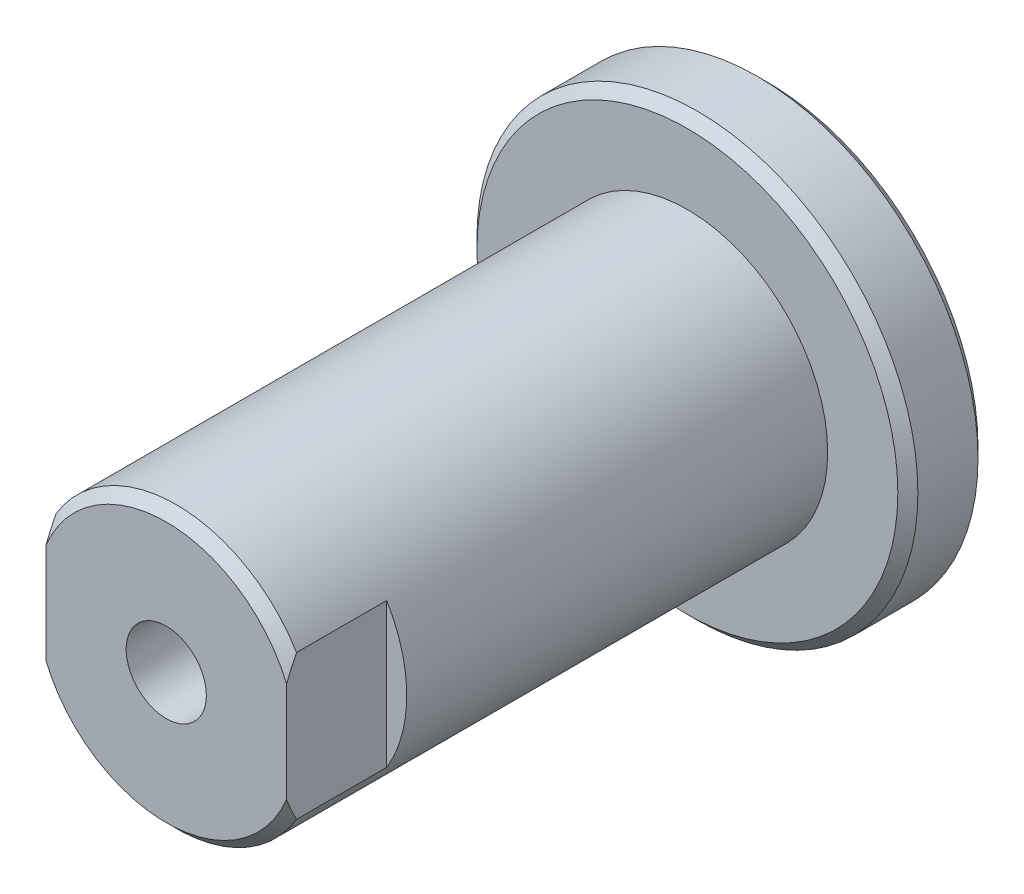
from build123d import *

# Parameters (mm, degrees)
ESQUISSE1_R                          = 11
EXTRUSION1_DEPTH                     = 4
ESQUISSE2_R                          = 7
EXTRUSION2_DEPTH                     = 26
CHANFREIN2_SIZE                      = 0.5
ESQUISSE3_W                          = 8.70842535
ESQUISSE3_H                          = 21.848357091
ESQUISSE3_W_2                        = 7.471725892
ESQUISSE3_H_2                        = 24.424814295
ENL_V_MAT_EXTRU_1_DEPTH              = 5
DIAM_TRE_DU_PER_AGE_4_0_4_000000_1_D = 4


with BuildPart() as part:
    # Esquisse1 → Extrusion1 (new body)
    with BuildSketch(Plane.XY):
        Circle(ESQUISSE1_R)
    extrude(amount=EXTRUSION1_DEPTH)

    # Esquisse2 → Extrusion2 (add)
    with BuildSketch(Plane.XY.offset(4)):
        Circle(ESQUISSE2_R)
    extrude(amount=EXTRUSION2_DEPTH)

    # Chanfrein2
    chanfrein2_edges = [part.edges().sort_by_distance(p)[0] for p in [
        (-11, 0, 0),
        (-11, 0, 4),
        (-7, 0, 30),
    ]]
    chamfer(chanfrein2_edges, length=CHANFREIN2_SIZE)

    # Esquisse3 → Enl_v. mat.-Extru.1 (cut)
    with BuildSketch(Plane.XY.offset(30)):
        with Locations((10.354212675, 0.309174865)):
            Rectangle(ESQUISSE3_W, ESQUISSE3_H)
        with Locations((-9.735862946, 1.597403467)):
            Rectangle(ESQUISSE3_W_2, ESQUISSE3_H_2)
    extrude(amount=-ENL_V_MAT_EXTRU_1_DEPTH, mode=Mode.SUBTRACT)

    # Diam_tre du per_age _4.0 _4.000000_1 (through all)
    with Locations(Plane.XY.offset(30)):
        with Locations((0, 0)):
            Hole(DIAM_TRE_DU_PER_AGE_4_0_4_000000_1_D / 2)


solid = part.part
